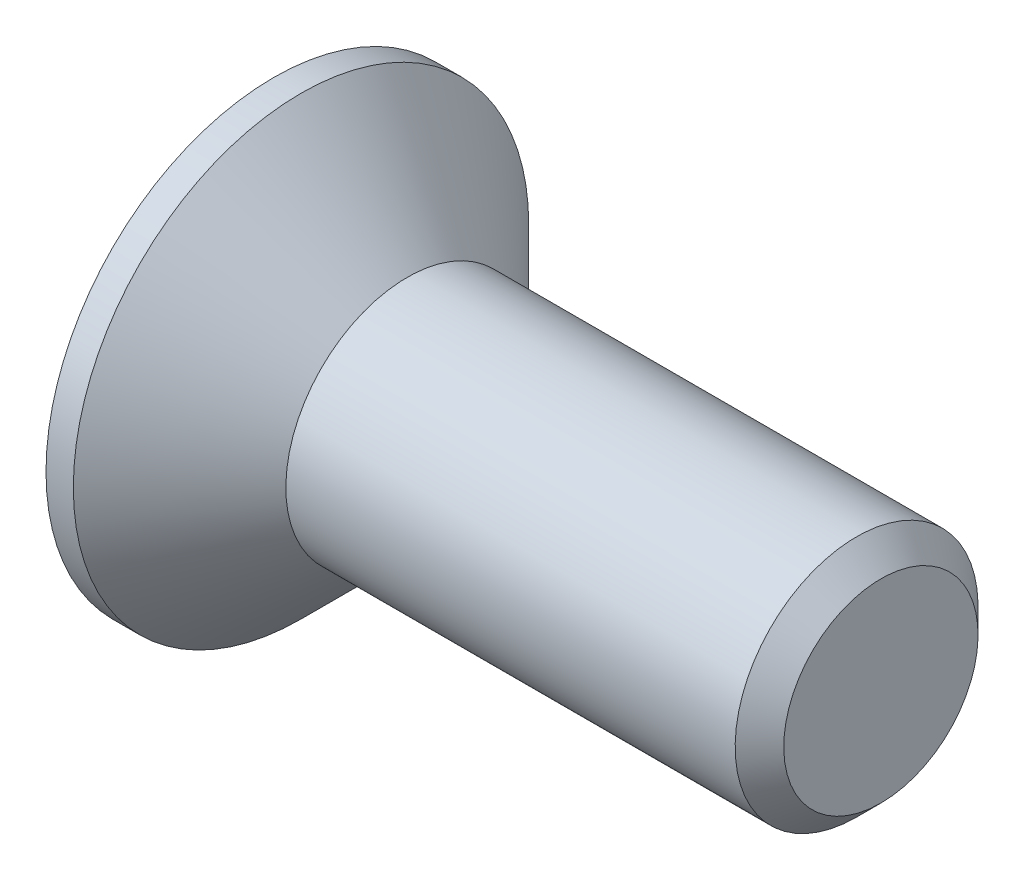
ISO-10303-21;
HEADER;
FILE_DESCRIPTION(('STEP AP214'),'2;1');
FILE_NAME('part.step','',(''),(''),'','','');
FILE_SCHEMA(('AUTOMOTIVE_DESIGN { 1 0 10303 214 1 1 1 1 }'));
ENDSEC;
DATA;
#1=APPLICATION_CONTEXT('core data for automotive mechanical design processes');
#2=APPLICATION_PROTOCOL_DEFINITION('international standard','automotive_design',2000,#1);
#3=PRODUCT_CONTEXT('',#1,'mechanical');
#4=PRODUCT('Part','Part','',(#3));
#5=PRODUCT_RELATED_PRODUCT_CATEGORY('part','',(#4));
#6=PRODUCT_DEFINITION_FORMATION('','',#4);
#7=PRODUCT_DEFINITION_CONTEXT('part definition',#1,'design');
#8=PRODUCT_DEFINITION('design','',#6,#7);
#9=PRODUCT_DEFINITION_SHAPE('','',#8);
#10=(LENGTH_UNIT() NAMED_UNIT(*) SI_UNIT(.MILLI.,.METRE.));
#11=(NAMED_UNIT(*) PLANE_ANGLE_UNIT() SI_UNIT($,.RADIAN.));
#12=(NAMED_UNIT(*) SI_UNIT($,.STERADIAN.) SOLID_ANGLE_UNIT());
#13=UNCERTAINTY_MEASURE_WITH_UNIT(LENGTH_MEASURE(1.E-05),#10,'distance_accuracy_value','');
#14=(GEOMETRIC_REPRESENTATION_CONTEXT(3) GLOBAL_UNCERTAINTY_ASSIGNED_CONTEXT((#13)) GLOBAL_UNIT_ASSIGNED_CONTEXT((#10,
#11,#12)) REPRESENTATION_CONTEXT('',''));
#15=CARTESIAN_POINT('',(0.,0.,0.));
#16=DIRECTION('',(0.,0.,1.));
#17=DIRECTION('',(1.,0.,0.));
#18=AXIS2_PLACEMENT_3D('',#15,#16,#17);
#19=CARTESIAN_POINT('',(0.,0.,0.));
#20=DIRECTION('',(-1.,0.,0.));
#21=DIRECTION('',(0.,-1.,0.));
#22=AXIS2_PLACEMENT_3D('',#19,#20,#21);
#23=CONICAL_SURFACE('',#22,2.,0.78539816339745);
#24=CARTESIAN_POINT('',(-1.74999999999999,0.,0.));
#25=DIRECTION('',(-1.,0.,0.));
#26=DIRECTION('',(0.,-1.,0.));
#27=AXIS2_PLACEMENT_3D('',#24,#25,#26);
#28=CIRCLE('',#27,3.75);
#29=CARTESIAN_POINT('',(-1.74999999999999,-3.75,0.));
#30=VERTEX_POINT('',#29);
#31=EDGE_CURVE('E189',#30,#30,#28,.T.);
#32=ORIENTED_EDGE('',*,*,#31,.F.);
#33=EDGE_LOOP('',(#32));
#34=FACE_BOUND('',#33,.T.);
#35=CARTESIAN_POINT('',(0.,0.,0.));
#36=DIRECTION('',(-1.,0.,0.));
#37=DIRECTION('',(0.,-1.,0.));
#38=AXIS2_PLACEMENT_3D('',#35,#36,#37);
#39=CIRCLE('',#38,2.);
#40=CARTESIAN_POINT('',(0.,-2.,0.));
#41=VERTEX_POINT('',#40);
#42=EDGE_CURVE('E212',#41,#41,#39,.T.);
#43=ORIENTED_EDGE('',*,*,#42,.T.);
#44=EDGE_LOOP('',(#43));
#45=FACE_BOUND('',#44,.T.);
#46=ADVANCED_FACE('F33',(#34,#45),#23,.T.);
#47=CARTESIAN_POINT('',(-2.2,0.,0.));
#48=DIRECTION('',(-1.,0.,0.));
#49=DIRECTION('',(0.,-1.,0.));
#50=AXIS2_PLACEMENT_3D('',#47,#48,#49);
#51=CYLINDRICAL_SURFACE('',#50,2.);
#52=CARTESIAN_POINT('',(7.4,0.,0.));
#53=DIRECTION('',(-1.,0.,0.));
#54=DIRECTION('',(0.,-1.,0.));
#55=AXIS2_PLACEMENT_3D('',#52,#53,#54);
#56=CIRCLE('',#55,2.);
#57=CARTESIAN_POINT('',(7.4,-2.,0.));
#58=VERTEX_POINT('',#57);
#59=EDGE_CURVE('E41',#58,#58,#56,.T.);
#60=ORIENTED_EDGE('',*,*,#59,.T.);
#61=EDGE_LOOP('',(#60));
#62=FACE_BOUND('',#61,.T.);
#63=ORIENTED_EDGE('',*,*,#42,.F.);
#64=EDGE_LOOP('',(#63));
#65=FACE_BOUND('',#64,.T.);
#66=ADVANCED_FACE('F217',(#62,#65),#51,.T.);
#67=CARTESIAN_POINT('',(7.8,0.,0.));
#68=DIRECTION('',(-1.,0.,0.));
#69=DIRECTION('',(0.,-1.,0.));
#70=AXIS2_PLACEMENT_3D('',#67,#68,#69);
#71=PLANE('',#70);
#72=CARTESIAN_POINT('',(7.8,0.,0.));
#73=DIRECTION('',(-1.,0.,0.));
#74=DIRECTION('',(0.,-1.,0.));
#75=AXIS2_PLACEMENT_3D('',#72,#73,#74);
#76=CIRCLE('',#75,1.6);
#77=CARTESIAN_POINT('',(7.8,-1.6,0.));
#78=VERTEX_POINT('',#77);
#79=EDGE_CURVE('E11',#78,#78,#76,.F.);
#80=ORIENTED_EDGE('',*,*,#79,.T.);
#81=EDGE_LOOP('',(#80));
#82=FACE_BOUND('',#81,.T.);
#83=ADVANCED_FACE('F239',(#82),#71,.F.);
#84=CARTESIAN_POINT('',(-2.2,3.75,0.));
#85=DIRECTION('',(1.,0.,0.));
#86=DIRECTION('',(0.,1.,0.));
#87=AXIS2_PLACEMENT_3D('',#84,#85,#86);
#88=PLANE('',#87);
#89=DIRECTION('',(0.,0.,-1.));
#90=VECTOR('',#89,1.);
#91=CARTESIAN_POINT('',(-2.2,0.55,-2.2));
#92=LINE('',#91,#90);
#93=CARTESIAN_POINT('',(-2.2,0.55,-0.55));
#94=VERTEX_POINT('',#93);
#95=CARTESIAN_POINT('',(-2.2,0.55,-2.2));
#96=VERTEX_POINT('',#95);
#97=EDGE_CURVE('E158',#94,#96,#92,.T.);
#98=ORIENTED_EDGE('',*,*,#97,.F.);
#99=DIRECTION('',(0.,-1.,0.));
#100=VECTOR('',#99,1.);
#101=CARTESIAN_POINT('',(-2.2,0.55,-0.55));
#102=LINE('',#101,#100);
#103=CARTESIAN_POINT('',(-2.2,2.2,-0.55));
#104=VERTEX_POINT('',#103);
#105=EDGE_CURVE('E48',#104,#94,#102,.T.);
#106=ORIENTED_EDGE('',*,*,#105,.F.);
#107=DIRECTION('',(0.,0.,-1.));
#108=VECTOR('',#107,1.);
#109=CARTESIAN_POINT('',(-2.2,2.2,-0.55));
#110=LINE('',#109,#108);
#111=CARTESIAN_POINT('',(-2.2,2.2,0.55));
#112=VERTEX_POINT('',#111);
#113=EDGE_CURVE('E185',#112,#104,#110,.T.);
#114=ORIENTED_EDGE('',*,*,#113,.F.);
#115=DIRECTION('',(0.,1.,0.));
#116=VECTOR('',#115,1.);
#117=CARTESIAN_POINT('',(-2.2,2.2,0.55));
#118=LINE('',#117,#116);
#119=CARTESIAN_POINT('',(-2.2,0.55,0.55));
#120=VERTEX_POINT('',#119);
#121=EDGE_CURVE('E183',#120,#112,#118,.T.);
#122=ORIENTED_EDGE('',*,*,#121,.F.);
#123=DIRECTION('',(0.,0.,-1.));
#124=VECTOR('',#123,1.);
#125=CARTESIAN_POINT('',(-2.2,0.55,0.55));
#126=LINE('',#125,#124);
#127=CARTESIAN_POINT('',(-2.2,0.55,2.2));
#128=VERTEX_POINT('',#127);
#129=EDGE_CURVE('E132',#128,#120,#126,.T.);
#130=ORIENTED_EDGE('',*,*,#129,.F.);
#131=DIRECTION('',(0.,1.,0.));
#132=VECTOR('',#131,1.);
#133=CARTESIAN_POINT('',(-2.2,0.55,2.2));
#134=LINE('',#133,#132);
#135=CARTESIAN_POINT('',(-2.2,-0.55,2.2));
#136=VERTEX_POINT('',#135);
#137=EDGE_CURVE('E179',#136,#128,#134,.T.);
#138=ORIENTED_EDGE('',*,*,#137,.F.);
#139=DIRECTION('',(0.,0.,1.));
#140=VECTOR('',#139,1.);
#141=CARTESIAN_POINT('',(-2.2,-0.55,2.2));
#142=LINE('',#141,#140);
#143=CARTESIAN_POINT('',(-2.2,-0.55,0.55));
#144=VERTEX_POINT('',#143);
#145=EDGE_CURVE('E176',#144,#136,#142,.T.);
#146=ORIENTED_EDGE('',*,*,#145,.F.);
#147=DIRECTION('',(0.,1.,0.));
#148=VECTOR('',#147,1.);
#149=CARTESIAN_POINT('',(-2.2,-0.55,0.55));
#150=LINE('',#149,#148);
#151=CARTESIAN_POINT('',(-2.2,-2.2,0.55));
#152=VERTEX_POINT('',#151);
#153=EDGE_CURVE('E173',#152,#144,#150,.T.);
#154=ORIENTED_EDGE('',*,*,#153,.F.);
#155=DIRECTION('',(0.,0.,1.));
#156=VECTOR('',#155,1.);
#157=CARTESIAN_POINT('',(-2.2,-2.2,0.55));
#158=LINE('',#157,#156);
#159=CARTESIAN_POINT('',(-2.2,-2.2,-0.55));
#160=VERTEX_POINT('',#159);
#161=EDGE_CURVE('E170',#160,#152,#158,.T.);
#162=ORIENTED_EDGE('',*,*,#161,.F.);
#163=DIRECTION('',(0.,-1.,0.));
#164=VECTOR('',#163,1.);
#165=CARTESIAN_POINT('',(-2.2,-2.2,-0.55));
#166=LINE('',#165,#164);
#167=CARTESIAN_POINT('',(-2.2,-0.55,-0.55));
#168=VERTEX_POINT('',#167);
#169=EDGE_CURVE('E167',#168,#160,#166,.T.);
#170=ORIENTED_EDGE('',*,*,#169,.F.);
#171=DIRECTION('',(0.,0.,1.));
#172=VECTOR('',#171,1.);
#173=CARTESIAN_POINT('',(-2.2,-0.55,-0.55));
#174=LINE('',#173,#172);
#175=CARTESIAN_POINT('',(-2.2,-0.55,-2.2));
#176=VERTEX_POINT('',#175);
#177=EDGE_CURVE('E164',#176,#168,#174,.T.);
#178=ORIENTED_EDGE('',*,*,#177,.F.);
#179=DIRECTION('',(0.,-1.,0.));
#180=VECTOR('',#179,1.);
#181=CARTESIAN_POINT('',(-2.2,-0.55,-2.2));
#182=LINE('',#181,#180);
#183=EDGE_CURVE('E161',#96,#176,#182,.T.);
#184=ORIENTED_EDGE('',*,*,#183,.F.);
#185=EDGE_LOOP('',(#98,#106,#114,#122,#130,#138,#146,#154,#162,#170,#178,#184));
#186=FACE_BOUND('',#185,.T.);
#187=CARTESIAN_POINT('',(-2.2,0.,0.));
#188=DIRECTION('',(-1.,0.,0.));
#189=DIRECTION('',(0.,-1.,0.));
#190=AXIS2_PLACEMENT_3D('',#187,#188,#189);
#191=CIRCLE('',#190,3.75);
#192=CARTESIAN_POINT('',(-2.2,-3.75,0.));
#193=VERTEX_POINT('',#192);
#194=EDGE_CURVE('E209',#193,#193,#191,.T.);
#195=ORIENTED_EDGE('',*,*,#194,.T.);
#196=EDGE_LOOP('',(#195));
#197=FACE_BOUND('',#196,.T.);
#198=ADVANCED_FACE('F230',(#186,#197),#88,.F.);
#199=CARTESIAN_POINT('',(-2.2,0.,0.));
#200=DIRECTION('',(-1.,0.,0.));
#201=DIRECTION('',(0.,-1.,0.));
#202=AXIS2_PLACEMENT_3D('',#199,#200,#201);
#203=CYLINDRICAL_SURFACE('',#202,3.75);
#204=ORIENTED_EDGE('',*,*,#194,.F.);
#205=EDGE_LOOP('',(#204));
#206=FACE_BOUND('',#205,.T.);
#207=ORIENTED_EDGE('',*,*,#31,.T.);
#208=EDGE_LOOP('',(#207));
#209=FACE_BOUND('',#208,.T.);
#210=ADVANCED_FACE('F222',(#206,#209),#203,.T.);
#211=CARTESIAN_POINT('',(7.4,0.,0.));
#212=DIRECTION('',(-1.,0.,0.));
#213=DIRECTION('',(0.,-1.,0.));
#214=AXIS2_PLACEMENT_3D('',#211,#212,#213);
#215=CONICAL_SURFACE('',#214,2.,0.785398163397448);
#216=CARTESIAN_POINT('',(7.8,-1.6,0.));
#217=CARTESIAN_POINT('',(7.79583333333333,-1.60416666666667,0.));
#218=CARTESIAN_POINT('',(7.79166666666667,-1.60833333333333,0.));
#219=CARTESIAN_POINT('',(7.78333333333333,-1.61666666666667,0.));
#220=CARTESIAN_POINT('',(7.77916666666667,-1.62083333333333,0.));
#221=CARTESIAN_POINT('',(7.77083333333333,-1.62916666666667,0.));
#222=CARTESIAN_POINT('',(7.76666666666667,-1.63333333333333,0.));
#223=CARTESIAN_POINT('',(7.75833333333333,-1.64166666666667,0.));
#224=CARTESIAN_POINT('',(7.75416666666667,-1.64583333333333,0.));
#225=CARTESIAN_POINT('',(7.74583333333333,-1.65416666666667,0.));
#226=CARTESIAN_POINT('',(7.74166666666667,-1.65833333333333,0.));
#227=CARTESIAN_POINT('',(7.73333333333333,-1.66666666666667,0.));
#228=CARTESIAN_POINT('',(7.72916666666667,-1.67083333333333,0.));
#229=CARTESIAN_POINT('',(7.72083333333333,-1.67916666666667,0.));
#230=CARTESIAN_POINT('',(7.71666666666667,-1.68333333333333,0.));
#231=CARTESIAN_POINT('',(7.70833333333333,-1.69166666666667,0.));
#232=CARTESIAN_POINT('',(7.70416666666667,-1.69583333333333,0.));
#233=CARTESIAN_POINT('',(7.69583333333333,-1.70416666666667,0.));
#234=CARTESIAN_POINT('',(7.69166666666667,-1.70833333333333,0.));
#235=CARTESIAN_POINT('',(7.68333333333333,-1.71666666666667,0.));
#236=CARTESIAN_POINT('',(7.67916666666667,-1.72083333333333,0.));
#237=CARTESIAN_POINT('',(7.67083333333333,-1.72916666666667,0.));
#238=CARTESIAN_POINT('',(7.66666666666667,-1.73333333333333,0.));
#239=CARTESIAN_POINT('',(7.65833333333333,-1.74166666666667,0.));
#240=CARTESIAN_POINT('',(7.65416666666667,-1.74583333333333,0.));
#241=CARTESIAN_POINT('',(7.64583333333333,-1.75416666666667,0.));
#242=CARTESIAN_POINT('',(7.64166666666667,-1.75833333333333,0.));
#243=CARTESIAN_POINT('',(7.63333333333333,-1.76666666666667,0.));
#244=CARTESIAN_POINT('',(7.62916666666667,-1.77083333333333,0.));
#245=CARTESIAN_POINT('',(7.62083333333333,-1.77916666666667,0.));
#246=CARTESIAN_POINT('',(7.61666666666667,-1.78333333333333,0.));
#247=CARTESIAN_POINT('',(7.60833333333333,-1.79166666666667,0.));
#248=CARTESIAN_POINT('',(7.60416666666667,-1.79583333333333,0.));
#249=CARTESIAN_POINT('',(7.59583333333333,-1.80416666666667,0.));
#250=CARTESIAN_POINT('',(7.59166666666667,-1.80833333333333,0.));
#251=CARTESIAN_POINT('',(7.58333333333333,-1.81666666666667,0.));
#252=CARTESIAN_POINT('',(7.57916666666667,-1.82083333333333,0.));
#253=CARTESIAN_POINT('',(7.57083333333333,-1.82916666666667,0.));
#254=CARTESIAN_POINT('',(7.56666666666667,-1.83333333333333,0.));
#255=CARTESIAN_POINT('',(7.55833333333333,-1.84166666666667,0.));
#256=CARTESIAN_POINT('',(7.55416666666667,-1.84583333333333,0.));
#257=CARTESIAN_POINT('',(7.54583333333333,-1.85416666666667,0.));
#258=CARTESIAN_POINT('',(7.54166666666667,-1.85833333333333,0.));
#259=CARTESIAN_POINT('',(7.53333333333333,-1.86666666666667,0.));
#260=CARTESIAN_POINT('',(7.52916666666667,-1.87083333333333,0.));
#261=CARTESIAN_POINT('',(7.52083333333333,-1.87916666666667,0.));
#262=CARTESIAN_POINT('',(7.51666666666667,-1.88333333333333,0.));
#263=CARTESIAN_POINT('',(7.50833333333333,-1.89166666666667,0.));
#264=CARTESIAN_POINT('',(7.50416666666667,-1.89583333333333,0.));
#265=CARTESIAN_POINT('',(7.49583333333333,-1.90416666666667,0.));
#266=CARTESIAN_POINT('',(7.49166666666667,-1.90833333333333,0.));
#267=CARTESIAN_POINT('',(7.48333333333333,-1.91666666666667,0.));
#268=CARTESIAN_POINT('',(7.47916666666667,-1.92083333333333,0.));
#269=CARTESIAN_POINT('',(7.47083333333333,-1.92916666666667,0.));
#270=CARTESIAN_POINT('',(7.46666666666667,-1.93333333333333,0.));
#271=CARTESIAN_POINT('',(7.45833333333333,-1.94166666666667,0.));
#272=CARTESIAN_POINT('',(7.45416666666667,-1.94583333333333,0.));
#273=CARTESIAN_POINT('',(7.44583333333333,-1.95416666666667,0.));
#274=CARTESIAN_POINT('',(7.44166666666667,-1.95833333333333,0.));
#275=CARTESIAN_POINT('',(7.43333333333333,-1.96666666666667,0.));
#276=CARTESIAN_POINT('',(7.42916666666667,-1.97083333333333,0.));
#277=CARTESIAN_POINT('',(7.42083333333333,-1.97916666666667,0.));
#278=CARTESIAN_POINT('',(7.41666666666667,-1.98333333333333,0.));
#279=CARTESIAN_POINT('',(7.40833333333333,-1.99166666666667,0.));
#280=CARTESIAN_POINT('',(7.40416666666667,-1.99583333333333,0.));
#281=CARTESIAN_POINT('',(7.4,-2.,0.));
#282=B_SPLINE_CURVE_WITH_KNOTS('',3,(#216,#217,#218,#219,#220,#221,#222,#223,#224,#225,#226,
#227,#228,#229,#230,#231,#232,#233,#234,#235,#236,#237,#238,#239,#240,#241,#242,#243,#244,#245,
#246,#247,#248,#249,#250,#251,#252,#253,#254,#255,#256,#257,#258,#259,#260,#261,#262,#263,#264,
#265,#266,#267,#268,#269,#270,#271,#272,#273,#274,#275,#276,#277,#278,#279,#280,#281),
.UNSPECIFIED.,.F.,.F.,(4,2,2,2,2,2,2,2,2,2,2,2,2,2,2,2,2,2,2,2,2,2,2,2,2,2,2,2,2,2,2,2,4),(0.,
0.0176776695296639,0.0353553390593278,0.0530330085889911,0.0707106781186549,0.0883883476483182,
0.106066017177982,0.123743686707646,0.141421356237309,0.159099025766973,0.176776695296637,
0.194454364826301,0.212132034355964,0.229809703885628,0.247487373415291,0.265165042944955,
0.282842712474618,0.300520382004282,0.318198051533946,0.335875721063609,0.353553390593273,
0.371231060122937,0.388908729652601,0.406586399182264,0.424264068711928,0.441941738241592,
0.459619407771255,0.477297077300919,0.494974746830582,0.512652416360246,0.530330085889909,
0.548007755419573,0.565685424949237),.UNSPECIFIED.);
#283=EDGE_CURVE('BSEAM35',#78,#58,#282,.T.);
#284=ORIENTED_EDGE('',*,*,#79,.F.);
#285=ORIENTED_EDGE('',*,*,#59,.F.);
#286=ORIENTED_EDGE('',*,*,#283,.T.);
#287=ORIENTED_EDGE('',*,*,#283,.F.);
#288=EDGE_LOOP('',(#284,#286,#285,#287));
#289=FACE_BOUND('',#288,.T.);
#290=ADVANCED_FACE('F35',(#289),#215,.T.);
#291=CARTESIAN_POINT('',(-0.3,0.55,-0.55));
#292=DIRECTION('',(0.,0.,-1.));
#293=DIRECTION('',(-1.,0.,0.));
#294=AXIS2_PLACEMENT_3D('',#291,#292,#293);
#295=PLANE('',#294);
#296=ORIENTED_EDGE('',*,*,#105,.T.);
#297=DIRECTION('',(-1.,0.,0.));
#298=VECTOR('',#297,1.);
#299=CARTESIAN_POINT('',(-0.3,0.55,-0.55));
#300=LINE('',#299,#298);
#301=CARTESIAN_POINT('',(-0.3,0.55,-0.55));
#302=VERTEX_POINT('',#301);
#303=EDGE_CURVE('E96',#302,#94,#300,.T.);
#304=ORIENTED_EDGE('',*,*,#303,.F.);
#305=DIRECTION('',(0.,-1.,0.));
#306=VECTOR('',#305,1.);
#307=CARTESIAN_POINT('',(-0.3,0.55,-0.55));
#308=LINE('',#307,#306);
#309=CARTESIAN_POINT('',(-0.3,2.2,-0.55));
#310=VERTEX_POINT('',#309);
#311=EDGE_CURVE('E187',#310,#302,#308,.T.);
#312=ORIENTED_EDGE('',*,*,#311,.F.);
#313=DIRECTION('',(-1.,0.,0.));
#314=VECTOR('',#313,1.);
#315=CARTESIAN_POINT('',(-0.3,2.2,-0.55));
#316=LINE('',#315,#314);
#317=EDGE_CURVE('E56',#310,#104,#316,.T.);
#318=ORIENTED_EDGE('',*,*,#317,.T.);
#319=EDGE_LOOP('',(#296,#304,#312,#318));
#320=FACE_BOUND('',#319,.T.);
#321=ADVANCED_FACE('F221',(#320),#295,.F.);
#322=CARTESIAN_POINT('',(-0.3,2.2,-0.55));
#323=DIRECTION('',(0.,1.,0.));
#324=DIRECTION('',(-1.,0.,0.));
#325=AXIS2_PLACEMENT_3D('',#322,#323,#324);
#326=PLANE('',#325);
#327=ORIENTED_EDGE('',*,*,#113,.T.);
#328=ORIENTED_EDGE('',*,*,#317,.F.);
#329=DIRECTION('',(0.,0.,-1.));
#330=VECTOR('',#329,1.);
#331=CARTESIAN_POINT('',(-0.3,2.2,-0.55));
#332=LINE('',#331,#330);
#333=CARTESIAN_POINT('',(-0.3,2.2,0.55));
#334=VERTEX_POINT('',#333);
#335=EDGE_CURVE('E144',#334,#310,#332,.T.);
#336=ORIENTED_EDGE('',*,*,#335,.F.);
#337=DIRECTION('',(-1.,0.,0.));
#338=VECTOR('',#337,1.);
#339=CARTESIAN_POINT('',(-0.3,2.2,0.55));
#340=LINE('',#339,#338);
#341=EDGE_CURVE('E136',#334,#112,#340,.T.);
#342=ORIENTED_EDGE('',*,*,#341,.T.);
#343=EDGE_LOOP('',(#327,#328,#336,#342));
#344=FACE_BOUND('',#343,.T.);
#345=ADVANCED_FACE('F228',(#344),#326,.F.);
#346=CARTESIAN_POINT('',(-0.3,2.2,0.55));
#347=DIRECTION('',(0.,0.,1.));
#348=DIRECTION('',(1.,0.,0.));
#349=AXIS2_PLACEMENT_3D('',#346,#347,#348);
#350=PLANE('',#349);
#351=ORIENTED_EDGE('',*,*,#121,.T.);
#352=ORIENTED_EDGE('',*,*,#341,.F.);
#353=DIRECTION('',(0.,1.,0.));
#354=VECTOR('',#353,1.);
#355=CARTESIAN_POINT('',(-0.3,2.2,0.55));
#356=LINE('',#355,#354);
#357=CARTESIAN_POINT('',(-0.3,0.55,0.55));
#358=VERTEX_POINT('',#357);
#359=EDGE_CURVE('E140',#358,#334,#356,.T.);
#360=ORIENTED_EDGE('',*,*,#359,.F.);
#361=DIRECTION('',(-1.,0.,0.));
#362=VECTOR('',#361,1.);
#363=CARTESIAN_POINT('',(-0.3,0.55,0.55));
#364=LINE('',#363,#362);
#365=EDGE_CURVE('E125',#358,#120,#364,.T.);
#366=ORIENTED_EDGE('',*,*,#365,.T.);
#367=EDGE_LOOP('',(#351,#352,#360,#366));
#368=FACE_BOUND('',#367,.T.);
#369=ADVANCED_FACE('F141',(#368),#350,.F.);
#370=CARTESIAN_POINT('',(-0.3,0.55,0.55));
#371=DIRECTION('',(0.,1.,0.));
#372=DIRECTION('',(-1.,0.,0.));
#373=AXIS2_PLACEMENT_3D('',#370,#371,#372);
#374=PLANE('',#373);
#375=ORIENTED_EDGE('',*,*,#129,.T.);
#376=ORIENTED_EDGE('',*,*,#365,.F.);
#377=DIRECTION('',(0.,0.,-1.));
#378=VECTOR('',#377,1.);
#379=CARTESIAN_POINT('',(-0.3,0.55,0.55));
#380=LINE('',#379,#378);
#381=CARTESIAN_POINT('',(-0.3,0.55,2.2));
#382=VERTEX_POINT('',#381);
#383=EDGE_CURVE('E129',#382,#358,#380,.T.);
#384=ORIENTED_EDGE('',*,*,#383,.F.);
#385=DIRECTION('',(-1.,0.,0.));
#386=VECTOR('',#385,1.);
#387=CARTESIAN_POINT('',(-0.3,0.55,2.2));
#388=LINE('',#387,#386);
#389=EDGE_CURVE('E137',#382,#128,#388,.T.);
#390=ORIENTED_EDGE('',*,*,#389,.T.);
#391=EDGE_LOOP('',(#375,#376,#384,#390));
#392=FACE_BOUND('',#391,.T.);
#393=ADVANCED_FACE('F127',(#392),#374,.F.);
#394=CARTESIAN_POINT('',(-0.3,0.55,2.2));
#395=DIRECTION('',(0.,0.,1.));
#396=DIRECTION('',(1.,0.,0.));
#397=AXIS2_PLACEMENT_3D('',#394,#395,#396);
#398=PLANE('',#397);
#399=ORIENTED_EDGE('',*,*,#137,.T.);
#400=ORIENTED_EDGE('',*,*,#389,.F.);
#401=DIRECTION('',(0.,1.,0.));
#402=VECTOR('',#401,1.);
#403=CARTESIAN_POINT('',(-0.3,0.55,2.2));
#404=LINE('',#403,#402);
#405=CARTESIAN_POINT('',(-0.3,-0.55,2.2));
#406=VERTEX_POINT('',#405);
#407=EDGE_CURVE('E150',#406,#382,#404,.T.);
#408=ORIENTED_EDGE('',*,*,#407,.F.);
#409=DIRECTION('',(-1.,0.,0.));
#410=VECTOR('',#409,1.);
#411=CARTESIAN_POINT('',(-0.3,-0.55,2.2));
#412=LINE('',#411,#410);
#413=EDGE_CURVE('E192',#406,#136,#412,.T.);
#414=ORIENTED_EDGE('',*,*,#413,.T.);
#415=EDGE_LOOP('',(#399,#400,#408,#414));
#416=FACE_BOUND('',#415,.T.);
#417=ADVANCED_FACE('F277',(#416),#398,.F.);
#418=CARTESIAN_POINT('',(-0.3,-0.55,2.2));
#419=DIRECTION('',(0.,-1.,0.));
#420=DIRECTION('',(1.,0.,0.));
#421=AXIS2_PLACEMENT_3D('',#418,#419,#420);
#422=PLANE('',#421);
#423=ORIENTED_EDGE('',*,*,#145,.T.);
#424=ORIENTED_EDGE('',*,*,#413,.F.);
#425=DIRECTION('',(0.,0.,1.));
#426=VECTOR('',#425,1.);
#427=CARTESIAN_POINT('',(-0.3,-0.55,2.2));
#428=LINE('',#427,#426);
#429=CARTESIAN_POINT('',(-0.3,-0.55,0.55));
#430=VERTEX_POINT('',#429);
#431=EDGE_CURVE('E152',#430,#406,#428,.T.);
#432=ORIENTED_EDGE('',*,*,#431,.F.);
#433=DIRECTION('',(-1.,0.,0.));
#434=VECTOR('',#433,1.);
#435=CARTESIAN_POINT('',(-0.3,-0.55,0.55));
#436=LINE('',#435,#434);
#437=EDGE_CURVE('E194',#430,#144,#436,.T.);
#438=ORIENTED_EDGE('',*,*,#437,.T.);
#439=EDGE_LOOP('',(#423,#424,#432,#438));
#440=FACE_BOUND('',#439,.T.);
#441=ADVANCED_FACE('F273',(#440),#422,.F.);
#442=CARTESIAN_POINT('',(-0.3,-0.55,0.55));
#443=DIRECTION('',(0.,0.,1.));
#444=DIRECTION('',(1.,0.,0.));
#445=AXIS2_PLACEMENT_3D('',#442,#443,#444);
#446=PLANE('',#445);
#447=ORIENTED_EDGE('',*,*,#153,.T.);
#448=ORIENTED_EDGE('',*,*,#437,.F.);
#449=DIRECTION('',(0.,1.,0.));
#450=VECTOR('',#449,1.);
#451=CARTESIAN_POINT('',(-0.3,-0.55,0.55));
#452=LINE('',#451,#450);
#453=CARTESIAN_POINT('',(-0.3,-2.2,0.55));
#454=VERTEX_POINT('',#453);
#455=EDGE_CURVE('E422',#454,#430,#452,.T.);
#456=ORIENTED_EDGE('',*,*,#455,.F.);
#457=DIRECTION('',(-1.,0.,0.));
#458=VECTOR('',#457,1.);
#459=CARTESIAN_POINT('',(-0.3,-2.2,0.55));
#460=LINE('',#459,#458);
#461=EDGE_CURVE('E196',#454,#152,#460,.T.);
#462=ORIENTED_EDGE('',*,*,#461,.T.);
#463=EDGE_LOOP('',(#447,#448,#456,#462));
#464=FACE_BOUND('',#463,.T.);
#465=ADVANCED_FACE('F269',(#464),#446,.F.);
#466=CARTESIAN_POINT('',(-0.3,-2.2,0.55));
#467=DIRECTION('',(0.,-1.,0.));
#468=DIRECTION('',(1.,0.,0.));
#469=AXIS2_PLACEMENT_3D('',#466,#467,#468);
#470=PLANE('',#469);
#471=ORIENTED_EDGE('',*,*,#161,.T.);
#472=ORIENTED_EDGE('',*,*,#461,.F.);
#473=DIRECTION('',(0.,0.,1.));
#474=VECTOR('',#473,1.);
#475=CARTESIAN_POINT('',(-0.3,-2.2,0.55));
#476=LINE('',#475,#474);
#477=CARTESIAN_POINT('',(-0.3,-2.2,-0.55));
#478=VERTEX_POINT('',#477);
#479=EDGE_CURVE('E419',#478,#454,#476,.T.);
#480=ORIENTED_EDGE('',*,*,#479,.F.);
#481=DIRECTION('',(-1.,0.,0.));
#482=VECTOR('',#481,1.);
#483=CARTESIAN_POINT('',(-0.3,-2.2,-0.55));
#484=LINE('',#483,#482);
#485=EDGE_CURVE('E198',#478,#160,#484,.T.);
#486=ORIENTED_EDGE('',*,*,#485,.T.);
#487=EDGE_LOOP('',(#471,#472,#480,#486));
#488=FACE_BOUND('',#487,.T.);
#489=ADVANCED_FACE('F265',(#488),#470,.F.);
#490=CARTESIAN_POINT('',(-0.3,-2.2,-0.55));
#491=DIRECTION('',(0.,0.,-1.));
#492=DIRECTION('',(-1.,0.,0.));
#493=AXIS2_PLACEMENT_3D('',#490,#491,#492);
#494=PLANE('',#493);
#495=ORIENTED_EDGE('',*,*,#169,.T.);
#496=ORIENTED_EDGE('',*,*,#485,.F.);
#497=DIRECTION('',(0.,-1.,0.));
#498=VECTOR('',#497,1.);
#499=CARTESIAN_POINT('',(-0.3,-2.2,-0.55));
#500=LINE('',#499,#498);
#501=CARTESIAN_POINT('',(-0.3,-0.55,-0.55));
#502=VERTEX_POINT('',#501);
#503=EDGE_CURVE('E416',#502,#478,#500,.T.);
#504=ORIENTED_EDGE('',*,*,#503,.F.);
#505=DIRECTION('',(-1.,0.,0.));
#506=VECTOR('',#505,1.);
#507=CARTESIAN_POINT('',(-0.3,-0.55,-0.55));
#508=LINE('',#507,#506);
#509=EDGE_CURVE('E200',#502,#168,#508,.T.);
#510=ORIENTED_EDGE('',*,*,#509,.T.);
#511=EDGE_LOOP('',(#495,#496,#504,#510));
#512=FACE_BOUND('',#511,.T.);
#513=ADVANCED_FACE('F261',(#512),#494,.F.);
#514=CARTESIAN_POINT('',(-0.3,-0.55,-0.55));
#515=DIRECTION('',(0.,-1.,0.));
#516=DIRECTION('',(1.,0.,0.));
#517=AXIS2_PLACEMENT_3D('',#514,#515,#516);
#518=PLANE('',#517);
#519=ORIENTED_EDGE('',*,*,#177,.T.);
#520=ORIENTED_EDGE('',*,*,#509,.F.);
#521=DIRECTION('',(0.,0.,1.));
#522=VECTOR('',#521,1.);
#523=CARTESIAN_POINT('',(-0.3,-0.55,-0.55));
#524=LINE('',#523,#522);
#525=CARTESIAN_POINT('',(-0.3,-0.55,-2.2));
#526=VERTEX_POINT('',#525);
#527=EDGE_CURVE('E413',#526,#502,#524,.T.);
#528=ORIENTED_EDGE('',*,*,#527,.F.);
#529=DIRECTION('',(-1.,0.,0.));
#530=VECTOR('',#529,1.);
#531=CARTESIAN_POINT('',(-0.3,-0.55,-2.2));
#532=LINE('',#531,#530);
#533=EDGE_CURVE('E202',#526,#176,#532,.T.);
#534=ORIENTED_EDGE('',*,*,#533,.T.);
#535=EDGE_LOOP('',(#519,#520,#528,#534));
#536=FACE_BOUND('',#535,.T.);
#537=ADVANCED_FACE('F257',(#536),#518,.F.);
#538=CARTESIAN_POINT('',(-0.3,-0.55,-2.2));
#539=DIRECTION('',(0.,0.,-1.));
#540=DIRECTION('',(-1.,0.,0.));
#541=AXIS2_PLACEMENT_3D('',#538,#539,#540);
#542=PLANE('',#541);
#543=ORIENTED_EDGE('',*,*,#183,.T.);
#544=ORIENTED_EDGE('',*,*,#533,.F.);
#545=DIRECTION('',(0.,-1.,0.));
#546=VECTOR('',#545,1.);
#547=CARTESIAN_POINT('',(-0.3,-0.55,-2.2));
#548=LINE('',#547,#546);
#549=CARTESIAN_POINT('',(-0.3,0.55,-2.2));
#550=VERTEX_POINT('',#549);
#551=EDGE_CURVE('E408',#550,#526,#548,.T.);
#552=ORIENTED_EDGE('',*,*,#551,.F.);
#553=DIRECTION('',(-1.,0.,0.));
#554=VECTOR('',#553,1.);
#555=CARTESIAN_POINT('',(-0.3,0.55,-2.2));
#556=LINE('',#555,#554);
#557=EDGE_CURVE('E204',#550,#96,#556,.T.);
#558=ORIENTED_EDGE('',*,*,#557,.T.);
#559=EDGE_LOOP('',(#543,#544,#552,#558));
#560=FACE_BOUND('',#559,.T.);
#561=ADVANCED_FACE('F253',(#560),#542,.F.);
#562=CARTESIAN_POINT('',(-0.3,0.55,-2.2));
#563=DIRECTION('',(0.,1.,0.));
#564=DIRECTION('',(-1.,0.,0.));
#565=AXIS2_PLACEMENT_3D('',#562,#563,#564);
#566=PLANE('',#565);
#567=ORIENTED_EDGE('',*,*,#97,.T.);
#568=ORIENTED_EDGE('',*,*,#557,.F.);
#569=DIRECTION('',(0.,0.,-1.));
#570=VECTOR('',#569,1.);
#571=CARTESIAN_POINT('',(-0.3,0.55,-2.2));
#572=LINE('',#571,#570);
#573=EDGE_CURVE('E406',#302,#550,#572,.T.);
#574=ORIENTED_EDGE('',*,*,#573,.F.);
#575=ORIENTED_EDGE('',*,*,#303,.T.);
#576=EDGE_LOOP('',(#567,#568,#574,#575));
#577=FACE_BOUND('',#576,.T.);
#578=ADVANCED_FACE('F250',(#577),#566,.F.);
#579=CARTESIAN_POINT('',(-0.3,0.,0.));
#580=DIRECTION('',(1.,0.,0.));
#581=DIRECTION('',(0.,0.,-1.));
#582=AXIS2_PLACEMENT_3D('',#579,#580,#581);
#583=PLANE('',#582);
#584=ORIENTED_EDGE('',*,*,#311,.T.);
#585=ORIENTED_EDGE('',*,*,#573,.T.);
#586=ORIENTED_EDGE('',*,*,#551,.T.);
#587=ORIENTED_EDGE('',*,*,#527,.T.);
#588=ORIENTED_EDGE('',*,*,#503,.T.);
#589=ORIENTED_EDGE('',*,*,#479,.T.);
#590=ORIENTED_EDGE('',*,*,#455,.T.);
#591=ORIENTED_EDGE('',*,*,#431,.T.);
#592=ORIENTED_EDGE('',*,*,#407,.T.);
#593=ORIENTED_EDGE('',*,*,#383,.T.);
#594=ORIENTED_EDGE('',*,*,#359,.T.);
#595=ORIENTED_EDGE('',*,*,#335,.T.);
#596=EDGE_LOOP('',(#584,#585,#586,#587,#588,#589,#590,#591,#592,#593,#594,#595));
#597=FACE_BOUND('',#596,.T.);
#598=ADVANCED_FACE('F147',(#597),#583,.F.);
#599=CLOSED_SHELL('',(#46,#66,#83,#198,#210,#290,#321,#345,#369,#393,#417,#441,#465,#489,#513,
#537,#561,#578,#598));
#600=MANIFOLD_SOLID_BREP('B2',#599);
#601=ADVANCED_BREP_SHAPE_REPRESENTATION('',(#18,#600),#14);
#602=SHAPE_DEFINITION_REPRESENTATION(#9,#601);
ENDSEC;
END-ISO-10303-21;
